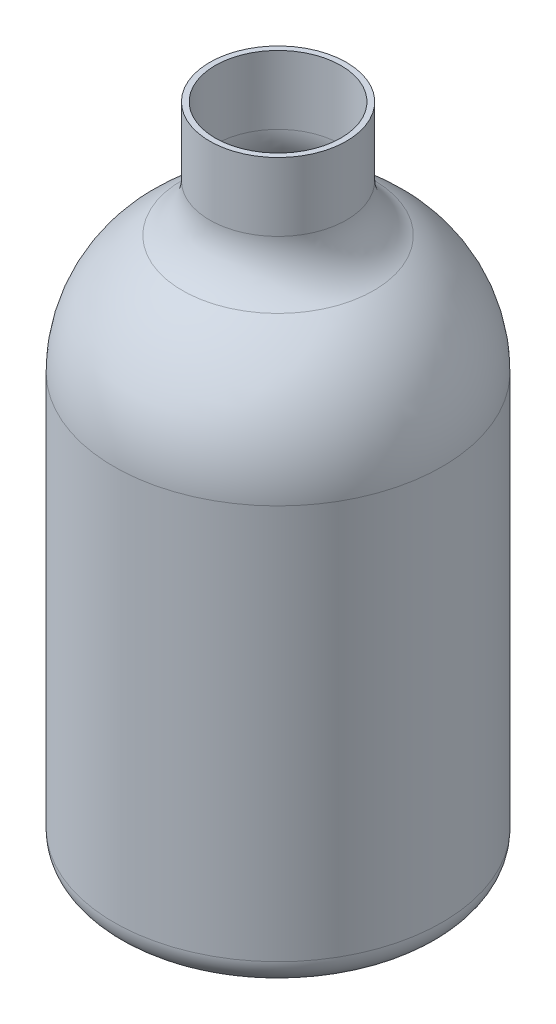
ISO-10303-21;
HEADER;
FILE_DESCRIPTION(('STEP AP214'),'2;1');
FILE_NAME('part.step','',(''),(''),'','','');
FILE_SCHEMA(('AUTOMOTIVE_DESIGN { 1 0 10303 214 1 1 1 1 }'));
ENDSEC;
DATA;
#1=APPLICATION_CONTEXT('core data for automotive mechanical design processes');
#2=APPLICATION_PROTOCOL_DEFINITION('international standard','automotive_design',2000,#1);
#3=PRODUCT_CONTEXT('',#1,'mechanical');
#4=PRODUCT('Part','Part','',(#3));
#5=PRODUCT_RELATED_PRODUCT_CATEGORY('part','',(#4));
#6=PRODUCT_DEFINITION_FORMATION('','',#4);
#7=PRODUCT_DEFINITION_CONTEXT('part definition',#1,'design');
#8=PRODUCT_DEFINITION('design','',#6,#7);
#9=PRODUCT_DEFINITION_SHAPE('','',#8);
#10=(LENGTH_UNIT() NAMED_UNIT(*) SI_UNIT(.MILLI.,.METRE.));
#11=(NAMED_UNIT(*) PLANE_ANGLE_UNIT() SI_UNIT($,.RADIAN.));
#12=(NAMED_UNIT(*) SI_UNIT($,.STERADIAN.) SOLID_ANGLE_UNIT());
#13=UNCERTAINTY_MEASURE_WITH_UNIT(LENGTH_MEASURE(1.E-05),#10,'distance_accuracy_value','');
#14=(GEOMETRIC_REPRESENTATION_CONTEXT(3) GLOBAL_UNCERTAINTY_ASSIGNED_CONTEXT((#13)) GLOBAL_UNIT_ASSIGNED_CONTEXT((#10,
#11,#12)) REPRESENTATION_CONTEXT('',''));
#15=CARTESIAN_POINT('',(0.,0.,0.));
#16=DIRECTION('',(0.,0.,1.));
#17=DIRECTION('',(1.,0.,0.));
#18=AXIS2_PLACEMENT_3D('',#15,#16,#17);
#19=CARTESIAN_POINT('',(0.,240.,0.));
#20=DIRECTION('',(0.,1.,0.));
#21=DIRECTION('',(0.,0.,1.));
#22=AXIS2_PLACEMENT_3D('',#19,#20,#21);
#23=PLANE('',#22);
#24=CARTESIAN_POINT('',(0.,240.,0.));
#25=DIRECTION('',(0.,-1.,0.));
#26=DIRECTION('',(0.,0.,-1.));
#27=AXIS2_PLACEMENT_3D('',#24,#25,#26);
#28=CIRCLE('',#27,25.);
#29=CARTESIAN_POINT('',(0.,240.,-25.));
#30=VERTEX_POINT('',#29);
#31=EDGE_CURVE('E54',#30,#30,#28,.T.);
#32=ORIENTED_EDGE('',*,*,#31,.F.);
#33=EDGE_LOOP('',(#32));
#34=FACE_BOUND('',#33,.T.);
#35=CARTESIAN_POINT('',(0.,240.,0.));
#36=DIRECTION('',(0.,1.,0.));
#37=DIRECTION('',(0.,0.,1.));
#38=AXIS2_PLACEMENT_3D('',#35,#36,#37);
#39=CIRCLE('',#38,23.);
#40=CARTESIAN_POINT('',(0.,240.,23.));
#41=VERTEX_POINT('',#40);
#42=EDGE_CURVE('E58',#41,#41,#39,.F.);
#43=ORIENTED_EDGE('',*,*,#42,.T.);
#44=EDGE_LOOP('',(#43));
#45=FACE_BOUND('',#44,.T.);
#46=ADVANCED_FACE('F31',(#34,#45),#23,.T.);
#47=CARTESIAN_POINT('',(0.,0.,0.));
#48=DIRECTION('',(0.,-1.,0.));
#49=DIRECTION('',(0.,0.,-1.));
#50=AXIS2_PLACEMENT_3D('',#47,#48,#49);
#51=PLANE('',#50);
#52=CARTESIAN_POINT('',(0.,0.,0.));
#53=DIRECTION('',(0.,-1.,0.));
#54=DIRECTION('',(0.,0.,-1.));
#55=AXIS2_PLACEMENT_3D('',#52,#53,#54);
#56=CIRCLE('',#55,50.);
#57=CARTESIAN_POINT('',(0.,0.,-50.));
#58=VERTEX_POINT('',#57);
#59=EDGE_CURVE('E10',#58,#58,#56,.T.);
#60=ORIENTED_EDGE('',*,*,#59,.T.);
#61=EDGE_LOOP('',(#60));
#62=FACE_BOUND('',#61,.T.);
#63=ADVANCED_FACE('F33',(#62),#51,.T.);
#64=CARTESIAN_POINT('',(0.,10.,0.));
#65=DIRECTION('',(0.,-1.,0.));
#66=DIRECTION('',(0.,0.,-1.));
#67=AXIS2_PLACEMENT_3D('',#64,#65,#66);
#68=TOROIDAL_SURFACE('',#67,50.,10.);
#69=CARTESIAN_POINT('',(0.,10.,0.));
#70=DIRECTION('',(0.,-1.,0.));
#71=DIRECTION('',(0.,0.,-1.));
#72=AXIS2_PLACEMENT_3D('',#69,#70,#71);
#73=CIRCLE('',#72,60.);
#74=CARTESIAN_POINT('',(0.,10.,-60.));
#75=VERTEX_POINT('',#74);
#76=EDGE_CURVE('E38',#75,#75,#73,.T.);
#77=ORIENTED_EDGE('',*,*,#76,.T.);
#78=EDGE_LOOP('',(#77));
#79=FACE_BOUND('',#78,.T.);
#80=ORIENTED_EDGE('',*,*,#59,.F.);
#81=EDGE_LOOP('',(#80));
#82=FACE_BOUND('',#81,.T.);
#83=ADVANCED_FACE('F98',(#79,#82),#68,.T.);
#84=CARTESIAN_POINT('',(0.,0.,0.));
#85=DIRECTION('',(0.,-1.,0.));
#86=DIRECTION('',(0.,0.,-1.));
#87=AXIS2_PLACEMENT_3D('',#84,#85,#86);
#88=CYLINDRICAL_SURFACE('',#87,60.);
#89=CARTESIAN_POINT('',(0.,154.378221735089,0.));
#90=DIRECTION('',(0.,-1.,0.));
#91=DIRECTION('',(0.,0.,-1.));
#92=AXIS2_PLACEMENT_3D('',#89,#90,#91);
#93=CIRCLE('',#92,60.);
#94=CARTESIAN_POINT('',(0.,154.378221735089,-60.));
#95=VERTEX_POINT('',#94);
#96=EDGE_CURVE('E42',#95,#95,#93,.T.);
#97=ORIENTED_EDGE('',*,*,#96,.T.);
#98=EDGE_LOOP('',(#97));
#99=FACE_BOUND('',#98,.T.);
#100=ORIENTED_EDGE('',*,*,#76,.F.);
#101=EDGE_LOOP('',(#100));
#102=FACE_BOUND('',#101,.T.);
#103=ADVANCED_FACE('F111',(#99,#102),#88,.T.);
#104=CARTESIAN_POINT('',(0.,154.378221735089,0.));
#105=DIRECTION('',(0.,-1.,0.));
#106=DIRECTION('',(0.,0.,-1.));
#107=AXIS2_PLACEMENT_3D('',#104,#105,#106);
#108=DEGENERATE_TOROIDAL_SURFACE('',#107,9.99999999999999,50.,.T.);
#109=CARTESIAN_POINT('',(0.,197.679491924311,0.));
#110=DIRECTION('',(0.,-1.,0.));
#111=DIRECTION('',(0.,0.,-1.));
#112=AXIS2_PLACEMENT_3D('',#109,#110,#111);
#113=CIRCLE('',#112,35.);
#114=CARTESIAN_POINT('',(0.,197.679491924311,-35.));
#115=VERTEX_POINT('',#114);
#116=EDGE_CURVE('E46',#115,#115,#113,.T.);
#117=ORIENTED_EDGE('',*,*,#116,.T.);
#118=EDGE_LOOP('',(#117));
#119=FACE_BOUND('',#118,.T.);
#120=ORIENTED_EDGE('',*,*,#96,.F.);
#121=EDGE_LOOP('',(#120));
#122=FACE_BOUND('',#121,.T.);
#123=ADVANCED_FACE('F107',(#119,#122),#108,.T.);
#124=CARTESIAN_POINT('',(0.,215.,0.));
#125=DIRECTION('',(0.,-1.,0.));
#126=DIRECTION('',(0.,0.,-1.));
#127=AXIS2_PLACEMENT_3D('',#124,#125,#126);
#128=TOROIDAL_SURFACE('',#127,45.,20.);
#129=CARTESIAN_POINT('',(0.,215.,0.));
#130=DIRECTION('',(0.,-1.,0.));
#131=DIRECTION('',(0.,0.,-1.));
#132=AXIS2_PLACEMENT_3D('',#129,#130,#131);
#133=CIRCLE('',#132,25.);
#134=CARTESIAN_POINT('',(0.,215.,-25.));
#135=VERTEX_POINT('',#134);
#136=EDGE_CURVE('E51',#135,#135,#133,.T.);
#137=ORIENTED_EDGE('',*,*,#136,.T.);
#138=EDGE_LOOP('',(#137));
#139=FACE_BOUND('',#138,.T.);
#140=ORIENTED_EDGE('',*,*,#116,.F.);
#141=EDGE_LOOP('',(#140));
#142=FACE_BOUND('',#141,.T.);
#143=ADVANCED_FACE('F89',(#139,#142),#128,.F.);
#144=CARTESIAN_POINT('',(0.,0.,0.));
#145=DIRECTION('',(0.,-1.,0.));
#146=DIRECTION('',(0.,0.,-1.));
#147=AXIS2_PLACEMENT_3D('',#144,#145,#146);
#148=CYLINDRICAL_SURFACE('',#147,25.);
#149=ORIENTED_EDGE('',*,*,#31,.T.);
#150=EDGE_LOOP('',(#149));
#151=FACE_BOUND('',#150,.T.);
#152=ORIENTED_EDGE('',*,*,#136,.F.);
#153=EDGE_LOOP('',(#152));
#154=FACE_BOUND('',#153,.T.);
#155=ADVANCED_FACE('F80',(#151,#154),#148,.T.);
#156=CARTESIAN_POINT('',(0.,2.,0.));
#157=DIRECTION('',(0.,-1.,0.));
#158=DIRECTION('',(0.,0.,-1.));
#159=AXIS2_PLACEMENT_3D('',#156,#157,#158);
#160=PLANE('',#159);
#161=CARTESIAN_POINT('',(0.,2.,0.));
#162=DIRECTION('',(0.,-1.,0.));
#163=DIRECTION('',(0.,0.,-1.));
#164=AXIS2_PLACEMENT_3D('',#161,#162,#163);
#165=CIRCLE('',#164,50.);
#166=CARTESIAN_POINT('',(0.,2.,-50.));
#167=VERTEX_POINT('',#166);
#168=EDGE_CURVE('E57',#167,#167,#165,.T.);
#169=ORIENTED_EDGE('',*,*,#168,.F.);
#170=EDGE_LOOP('',(#169));
#171=FACE_BOUND('',#170,.T.);
#172=ADVANCED_FACE('F78',(#171),#160,.F.);
#173=CARTESIAN_POINT('',(0.,10.,0.));
#174=DIRECTION('',(0.,-1.,0.));
#175=DIRECTION('',(0.,0.,-1.));
#176=AXIS2_PLACEMENT_3D('',#173,#174,#175);
#177=TOROIDAL_SURFACE('',#176,50.,8.);
#178=CARTESIAN_POINT('',(0.,10.,0.));
#179=DIRECTION('',(0.,-1.,0.));
#180=DIRECTION('',(0.,0.,-1.));
#181=AXIS2_PLACEMENT_3D('',#178,#179,#180);
#182=CIRCLE('',#181,58.);
#183=CARTESIAN_POINT('',(0.,10.,-58.));
#184=VERTEX_POINT('',#183);
#185=EDGE_CURVE('E70',#184,#184,#182,.T.);
#186=ORIENTED_EDGE('',*,*,#185,.F.);
#187=EDGE_LOOP('',(#186));
#188=FACE_BOUND('',#187,.T.);
#189=ORIENTED_EDGE('',*,*,#168,.T.);
#190=EDGE_LOOP('',(#189));
#191=FACE_BOUND('',#190,.T.);
#192=ADVANCED_FACE('F76',(#188,#191),#177,.F.);
#193=CARTESIAN_POINT('',(0.,0.,0.));
#194=DIRECTION('',(0.,-1.,0.));
#195=DIRECTION('',(0.,0.,-1.));
#196=AXIS2_PLACEMENT_3D('',#193,#194,#195);
#197=CYLINDRICAL_SURFACE('',#196,58.);
#198=CARTESIAN_POINT('',(0.,154.378221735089,0.));
#199=DIRECTION('',(0.,-1.,0.));
#200=DIRECTION('',(0.,0.,-1.));
#201=AXIS2_PLACEMENT_3D('',#198,#199,#200);
#202=CIRCLE('',#201,58.);
#203=CARTESIAN_POINT('',(0.,154.378221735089,-58.));
#204=VERTEX_POINT('',#203);
#205=EDGE_CURVE('E67',#204,#204,#202,.T.);
#206=ORIENTED_EDGE('',*,*,#205,.F.);
#207=EDGE_LOOP('',(#206));
#208=FACE_BOUND('',#207,.T.);
#209=ORIENTED_EDGE('',*,*,#185,.T.);
#210=EDGE_LOOP('',(#209));
#211=FACE_BOUND('',#210,.T.);
#212=ADVANCED_FACE('F86',(#208,#211),#197,.F.);
#213=CARTESIAN_POINT('',(0.,154.378221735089,0.));
#214=DIRECTION('',(0.,-1.,0.));
#215=DIRECTION('',(0.,0.,-1.));
#216=AXIS2_PLACEMENT_3D('',#213,#214,#215);
#217=DEGENERATE_TOROIDAL_SURFACE('',#216,9.99999999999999,48.,.T.);
#218=CARTESIAN_POINT('',(0.,195.947441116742,0.));
#219=DIRECTION('',(0.,-1.,0.));
#220=DIRECTION('',(0.,0.,-1.));
#221=AXIS2_PLACEMENT_3D('',#218,#219,#220);
#222=CIRCLE('',#221,34.);
#223=CARTESIAN_POINT('',(0.,195.947441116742,-34.));
#224=VERTEX_POINT('',#223);
#225=EDGE_CURVE('E64',#224,#224,#222,.T.);
#226=ORIENTED_EDGE('',*,*,#225,.F.);
#227=EDGE_LOOP('',(#226));
#228=FACE_BOUND('',#227,.T.);
#229=ORIENTED_EDGE('',*,*,#205,.T.);
#230=EDGE_LOOP('',(#229));
#231=FACE_BOUND('',#230,.T.);
#232=ADVANCED_FACE('F160',(#228,#231),#217,.F.);
#233=CARTESIAN_POINT('',(0.,215.,0.));
#234=DIRECTION('',(0.,-1.,0.));
#235=DIRECTION('',(0.,0.,-1.));
#236=AXIS2_PLACEMENT_3D('',#233,#234,#235);
#237=TOROIDAL_SURFACE('',#236,45.,22.);
#238=CARTESIAN_POINT('',(0.,215.,0.));
#239=DIRECTION('',(0.,-1.,0.));
#240=DIRECTION('',(0.,0.,-1.));
#241=AXIS2_PLACEMENT_3D('',#238,#239,#240);
#242=CIRCLE('',#241,23.);
#243=CARTESIAN_POINT('',(0.,215.,-23.));
#244=VERTEX_POINT('',#243);
#245=EDGE_CURVE('E61',#244,#244,#242,.T.);
#246=ORIENTED_EDGE('',*,*,#245,.F.);
#247=EDGE_LOOP('',(#246));
#248=FACE_BOUND('',#247,.T.);
#249=ORIENTED_EDGE('',*,*,#225,.T.);
#250=EDGE_LOOP('',(#249));
#251=FACE_BOUND('',#250,.T.);
#252=ADVANCED_FACE('F170',(#248,#251),#237,.T.);
#253=CARTESIAN_POINT('',(0.,0.,0.));
#254=DIRECTION('',(0.,-1.,0.));
#255=DIRECTION('',(0.,0.,-1.));
#256=AXIS2_PLACEMENT_3D('',#253,#254,#255);
#257=CYLINDRICAL_SURFACE('',#256,23.);
#258=ORIENTED_EDGE('',*,*,#42,.F.);
#259=EDGE_LOOP('',(#258));
#260=FACE_BOUND('',#259,.T.);
#261=ORIENTED_EDGE('',*,*,#245,.T.);
#262=EDGE_LOOP('',(#261));
#263=FACE_BOUND('',#262,.T.);
#264=ADVANCED_FACE('F102',(#260,#263),#257,.F.);
#265=CLOSED_SHELL('',(#46,#63,#83,#103,#123,#143,#155,#172,#192,#212,#232,#252,#264));
#266=MANIFOLD_SOLID_BREP('B2',#265);
#267=ADVANCED_BREP_SHAPE_REPRESENTATION('',(#18,#266),#14);
#268=SHAPE_DEFINITION_REPRESENTATION(#9,#267);
ENDSEC;
END-ISO-10303-21;
